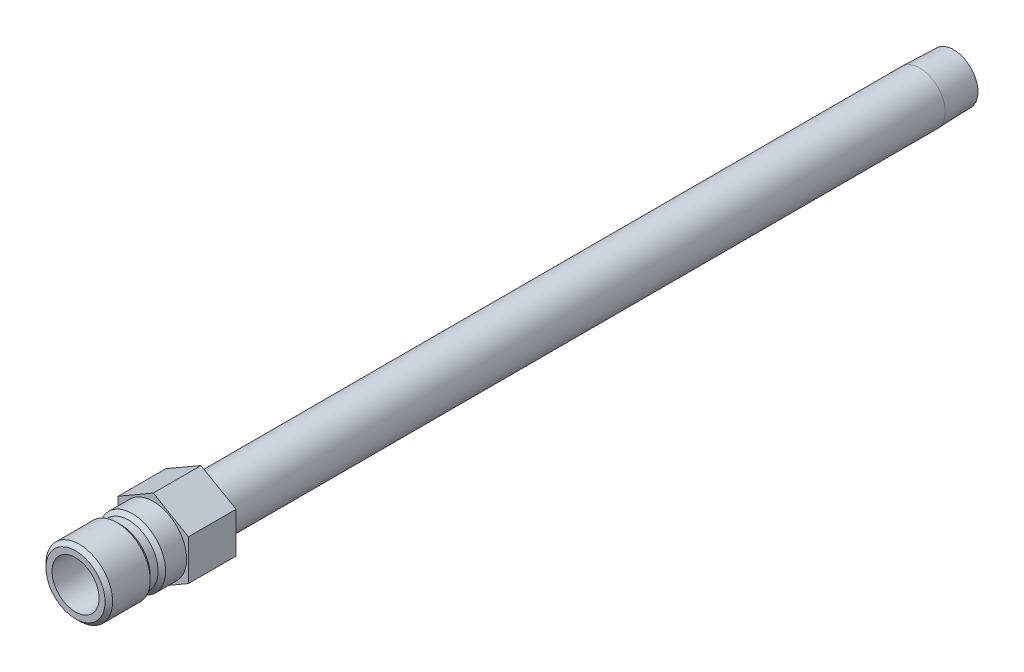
ISO-10303-21;
HEADER;
FILE_DESCRIPTION(('STEP AP214'),'2;1');
FILE_NAME('part.step','',(''),(''),'','','');
FILE_SCHEMA(('AUTOMOTIVE_DESIGN { 1 0 10303 214 1 1 1 1 }'));
ENDSEC;
DATA;
#1=APPLICATION_CONTEXT('core data for automotive mechanical design processes');
#2=APPLICATION_PROTOCOL_DEFINITION('international standard','automotive_design',2000,#1);
#3=PRODUCT_CONTEXT('',#1,'mechanical');
#4=PRODUCT('Part','Part','',(#3));
#5=PRODUCT_RELATED_PRODUCT_CATEGORY('part','',(#4));
#6=PRODUCT_DEFINITION_FORMATION('','',#4);
#7=PRODUCT_DEFINITION_CONTEXT('part definition',#1,'design');
#8=PRODUCT_DEFINITION('design','',#6,#7);
#9=PRODUCT_DEFINITION_SHAPE('','',#8);
#10=(LENGTH_UNIT() NAMED_UNIT(*) SI_UNIT(.MILLI.,.METRE.));
#11=(NAMED_UNIT(*) PLANE_ANGLE_UNIT() SI_UNIT($,.RADIAN.));
#12=(NAMED_UNIT(*) SI_UNIT($,.STERADIAN.) SOLID_ANGLE_UNIT());
#13=UNCERTAINTY_MEASURE_WITH_UNIT(LENGTH_MEASURE(1.E-05),#10,'distance_accuracy_value','');
#14=(GEOMETRIC_REPRESENTATION_CONTEXT(3) GLOBAL_UNCERTAINTY_ASSIGNED_CONTEXT((#13)) GLOBAL_UNIT_ASSIGNED_CONTEXT((#10,
#11,#12)) REPRESENTATION_CONTEXT('',''));
#15=CARTESIAN_POINT('',(0.,0.,0.));
#16=DIRECTION('',(0.,0.,1.));
#17=DIRECTION('',(1.,0.,0.));
#18=AXIS2_PLACEMENT_3D('',#15,#16,#17);
#19=CARTESIAN_POINT('',(0.,0.,-9.652));
#20=DIRECTION('',(0.,0.,-1.));
#21=DIRECTION('',(0.,1.,0.));
#22=AXIS2_PLACEMENT_3D('',#19,#20,#21);
#23=CYLINDRICAL_SURFACE('',#22,4.7625);
#24=CARTESIAN_POINT('',(0.,0.,3.556));
#25=DIRECTION('',(0.,0.,-1.));
#26=DIRECTION('',(0.,1.,0.));
#27=AXIS2_PLACEMENT_3D('',#24,#25,#26);
#28=CIRCLE('',#27,4.7625);
#29=CARTESIAN_POINT('',(0.,4.7625,3.556));
#30=VERTEX_POINT('',#29);
#31=EDGE_CURVE('E137',#30,#30,#28,.T.);
#32=ORIENTED_EDGE('',*,*,#31,.T.);
#33=EDGE_LOOP('',(#32));
#34=FACE_BOUND('',#33,.T.);
#35=CARTESIAN_POINT('',(0.,0.,15.748));
#36=DIRECTION('',(0.,0.,-1.));
#37=DIRECTION('',(0.,1.,0.));
#38=AXIS2_PLACEMENT_3D('',#35,#36,#37);
#39=CIRCLE('',#38,4.7625);
#40=CARTESIAN_POINT('',(0.,4.7625,15.748));
#41=VERTEX_POINT('',#40);
#42=EDGE_CURVE('E41',#41,#41,#39,.T.);
#43=ORIENTED_EDGE('',*,*,#42,.F.);
#44=EDGE_LOOP('',(#43));
#45=FACE_BOUND('',#44,.T.);
#46=ADVANCED_FACE('F33',(#34,#45),#23,.F.);
#47=CARTESIAN_POINT('',(0.,4.7625,15.748));
#48=DIRECTION('',(0.,0.,1.));
#49=DIRECTION('',(0.,-1.,0.));
#50=AXIS2_PLACEMENT_3D('',#47,#48,#49);
#51=PLANE('',#50);
#52=ORIENTED_EDGE('',*,*,#42,.T.);
#53=EDGE_LOOP('',(#52));
#54=FACE_BOUND('',#53,.T.);
#55=CARTESIAN_POINT('',(0.,0.,15.748));
#56=DIRECTION('',(0.,0.,-1.));
#57=DIRECTION('',(0.,1.,0.));
#58=AXIS2_PLACEMENT_3D('',#55,#56,#57);
#59=CIRCLE('',#58,5.9817);
#60=CARTESIAN_POINT('',(0.,5.9817,15.748));
#61=VERTEX_POINT('',#60);
#62=EDGE_CURVE('E175',#61,#61,#59,.T.);
#63=ORIENTED_EDGE('',*,*,#62,.F.);
#64=EDGE_LOOP('',(#63));
#65=FACE_BOUND('',#64,.T.);
#66=ADVANCED_FACE('F180',(#54,#65),#51,.T.);
#67=CARTESIAN_POINT('',(0.,0.,14.986));
#68=DIRECTION('',(0.,0.,-1.));
#69=DIRECTION('',(0.,1.,0.));
#70=AXIS2_PLACEMENT_3D('',#67,#68,#69);
#71=CONICAL_SURFACE('',#70,6.7437,0.785398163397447);
#72=ORIENTED_EDGE('',*,*,#62,.T.);
#73=EDGE_LOOP('',(#72));
#74=FACE_BOUND('',#73,.T.);
#75=CARTESIAN_POINT('',(0.,0.,14.986));
#76=DIRECTION('',(0.,0.,-1.));
#77=DIRECTION('',(0.,1.,0.));
#78=AXIS2_PLACEMENT_3D('',#75,#76,#77);
#79=CIRCLE('',#78,6.7437);
#80=CARTESIAN_POINT('',(0.,6.7437,14.986));
#81=VERTEX_POINT('',#80);
#82=EDGE_CURVE('E172',#81,#81,#79,.T.);
#83=ORIENTED_EDGE('',*,*,#82,.F.);
#84=EDGE_LOOP('',(#83));
#85=FACE_BOUND('',#84,.T.);
#86=ADVANCED_FACE('F188',(#74,#85),#71,.T.);
#87=CARTESIAN_POINT('',(0.,0.,-9.652));
#88=DIRECTION('',(0.,0.,-1.));
#89=DIRECTION('',(0.,1.,0.));
#90=AXIS2_PLACEMENT_3D('',#87,#88,#89);
#91=CYLINDRICAL_SURFACE('',#90,6.7437);
#92=ORIENTED_EDGE('',*,*,#82,.T.);
#93=EDGE_LOOP('',(#92));
#94=FACE_BOUND('',#93,.T.);
#95=CARTESIAN_POINT('',(0.,0.,7.366));
#96=DIRECTION('',(0.,0.,-1.));
#97=DIRECTION('',(0.,1.,0.));
#98=AXIS2_PLACEMENT_3D('',#95,#96,#97);
#99=CIRCLE('',#98,6.7437);
#100=CARTESIAN_POINT('',(0.,6.7437,7.366));
#101=VERTEX_POINT('',#100);
#102=EDGE_CURVE('E169',#101,#101,#99,.T.);
#103=ORIENTED_EDGE('',*,*,#102,.F.);
#104=EDGE_LOOP('',(#103));
#105=FACE_BOUND('',#104,.T.);
#106=ADVANCED_FACE('F237',(#94,#105),#91,.T.);
#107=CARTESIAN_POINT('',(0.,0.,6.604));
#108=DIRECTION('',(0.,0.,1.));
#109=DIRECTION('',(0.,-1.,0.));
#110=AXIS2_PLACEMENT_3D('',#107,#108,#109);
#111=CONICAL_SURFACE('',#110,5.9817,0.785398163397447);
#112=ORIENTED_EDGE('',*,*,#102,.T.);
#113=EDGE_LOOP('',(#112));
#114=FACE_BOUND('',#113,.T.);
#115=CARTESIAN_POINT('',(0.,0.,6.604));
#116=DIRECTION('',(0.,0.,-1.));
#117=DIRECTION('',(0.,1.,0.));
#118=AXIS2_PLACEMENT_3D('',#115,#116,#117);
#119=CIRCLE('',#118,5.9817);
#120=CARTESIAN_POINT('',(0.,5.9817,6.604));
#121=VERTEX_POINT('',#120);
#122=EDGE_CURVE('E166',#121,#121,#119,.T.);
#123=ORIENTED_EDGE('',*,*,#122,.F.);
#124=EDGE_LOOP('',(#123));
#125=FACE_BOUND('',#124,.T.);
#126=ADVANCED_FACE('F233',(#114,#125),#111,.T.);
#127=CARTESIAN_POINT('',(0.,0.,-9.652));
#128=DIRECTION('',(0.,0.,-1.));
#129=DIRECTION('',(0.,1.,0.));
#130=AXIS2_PLACEMENT_3D('',#127,#128,#129);
#131=CYLINDRICAL_SURFACE('',#130,5.9817);
#132=ORIENTED_EDGE('',*,*,#122,.T.);
#133=EDGE_LOOP('',(#132));
#134=FACE_BOUND('',#133,.T.);
#135=CARTESIAN_POINT('',(0.,0.,5.0165));
#136=DIRECTION('',(0.,0.,-1.));
#137=DIRECTION('',(0.,1.,0.));
#138=AXIS2_PLACEMENT_3D('',#135,#136,#137);
#139=CIRCLE('',#138,5.9817);
#140=CARTESIAN_POINT('',(0.,5.9817,5.0165));
#141=VERTEX_POINT('',#140);
#142=EDGE_CURVE('E163',#141,#141,#139,.T.);
#143=ORIENTED_EDGE('',*,*,#142,.F.);
#144=EDGE_LOOP('',(#143));
#145=FACE_BOUND('',#144,.T.);
#146=ADVANCED_FACE('F229',(#134,#145),#131,.T.);
#147=CARTESIAN_POINT('',(0.,0.,4.2545));
#148=DIRECTION('',(0.,0.,-1.));
#149=DIRECTION('',(0.,1.,0.));
#150=AXIS2_PLACEMENT_3D('',#147,#148,#149);
#151=CONICAL_SURFACE('',#150,6.7437,0.785398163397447);
#152=ORIENTED_EDGE('',*,*,#142,.T.);
#153=EDGE_LOOP('',(#152));
#154=FACE_BOUND('',#153,.T.);
#155=CARTESIAN_POINT('',(0.,0.,4.2545));
#156=DIRECTION('',(0.,0.,-1.));
#157=DIRECTION('',(0.,1.,0.));
#158=AXIS2_PLACEMENT_3D('',#155,#156,#157);
#159=CIRCLE('',#158,6.7437);
#160=CARTESIAN_POINT('',(0.,6.7437,4.2545));
#161=VERTEX_POINT('',#160);
#162=EDGE_CURVE('E160',#161,#161,#159,.T.);
#163=ORIENTED_EDGE('',*,*,#162,.F.);
#164=EDGE_LOOP('',(#163));
#165=FACE_BOUND('',#164,.T.);
#166=ADVANCED_FACE('F225',(#154,#165),#151,.T.);
#167=CARTESIAN_POINT('',(0.,0.,-9.652));
#168=DIRECTION('',(0.,0.,-1.));
#169=DIRECTION('',(0.,1.,0.));
#170=AXIS2_PLACEMENT_3D('',#167,#168,#169);
#171=CYLINDRICAL_SURFACE('',#170,6.7437);
#172=CARTESIAN_POINT('',(0.,0.,0.));
#173=DIRECTION('',(0.,0.,1.));
#174=DIRECTION('',(1.,0.,0.));
#175=AXIS2_PLACEMENT_3D('',#172,#173,#174);
#176=CIRCLE('',#175,6.7437);
#177=CARTESIAN_POINT('',(6.7437,0.,0.));
#178=VERTEX_POINT('',#177);
#179=EDGE_CURVE('E11',#178,#178,#176,.F.);
#180=ORIENTED_EDGE('',*,*,#179,.F.);
#181=EDGE_LOOP('',(#180));
#182=FACE_BOUND('',#181,.T.);
#183=ORIENTED_EDGE('',*,*,#162,.T.);
#184=EDGE_LOOP('',(#183));
#185=FACE_BOUND('',#184,.T.);
#186=ADVANCED_FACE('F221',(#182,#185),#171,.T.);
#187=CARTESIAN_POINT('',(0.,6.7437,-9.652));
#188=DIRECTION('',(0.,0.,-1.));
#189=DIRECTION('',(0.,1.,0.));
#190=AXIS2_PLACEMENT_3D('',#187,#188,#189);
#191=PLANE('',#190);
#192=CARTESIAN_POINT('',(0.,0.,-9.652));
#193=DIRECTION('',(0.,0.,-1.));
#194=DIRECTION('',(0.,1.,0.));
#195=AXIS2_PLACEMENT_3D('',#192,#193,#194);
#196=CIRCLE('',#195,5.1435);
#197=CARTESIAN_POINT('',(0.,5.1435,-9.652));
#198=VERTEX_POINT('',#197);
#199=EDGE_CURVE('E157',#198,#198,#196,.T.);
#200=ORIENTED_EDGE('',*,*,#199,.F.);
#201=EDGE_LOOP('',(#200));
#202=FACE_BOUND('',#201,.T.);
#203=DIRECTION('',(-0.866025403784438,-0.5,0.));
#204=VECTOR('',#203,1.);
#205=CARTESIAN_POINT('',(0.,8.21223022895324,-9.652));
#206=LINE('',#205,#204);
#207=CARTESIAN_POINT('',(0.,8.21223022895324,-9.652));
#208=VERTEX_POINT('',#207);
#209=CARTESIAN_POINT('',(-7.112,4.10611511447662,-9.652));
#210=VERTEX_POINT('',#209);
#211=EDGE_CURVE('E135',#208,#210,#206,.T.);
#212=ORIENTED_EDGE('',*,*,#211,.F.);
#213=DIRECTION('',(-0.866025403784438,0.5,0.));
#214=VECTOR('',#213,1.);
#215=CARTESIAN_POINT('',(7.112,4.10611511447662,-9.652));
#216=LINE('',#215,#214);
#217=CARTESIAN_POINT('',(7.112,4.10611511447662,-9.652));
#218=VERTEX_POINT('',#217);
#219=EDGE_CURVE('E110',#218,#208,#216,.T.);
#220=ORIENTED_EDGE('',*,*,#219,.F.);
#221=DIRECTION('',(0.,1.,0.));
#222=VECTOR('',#221,1.);
#223=CARTESIAN_POINT('',(7.112,-4.10611511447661,-9.652));
#224=LINE('',#223,#222);
#225=CARTESIAN_POINT('',(7.112,-4.10611511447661,-9.652));
#226=VERTEX_POINT('',#225);
#227=EDGE_CURVE('E95',#226,#218,#224,.T.);
#228=ORIENTED_EDGE('',*,*,#227,.F.);
#229=DIRECTION('',(0.866025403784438,0.5,0.));
#230=VECTOR('',#229,1.);
#231=CARTESIAN_POINT('',(0.,-8.21223022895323,-9.652));
#232=LINE('',#231,#230);
#233=CARTESIAN_POINT('',(0.,-8.21223022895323,-9.652));
#234=VERTEX_POINT('',#233);
#235=EDGE_CURVE('E108',#234,#226,#232,.T.);
#236=ORIENTED_EDGE('',*,*,#235,.F.);
#237=DIRECTION('',(0.866025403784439,-0.5,0.));
#238=VECTOR('',#237,1.);
#239=CARTESIAN_POINT('',(-7.112,-4.10611511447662,-9.652));
#240=LINE('',#239,#238);
#241=CARTESIAN_POINT('',(-7.112,-4.10611511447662,-9.652));
#242=VERTEX_POINT('',#241);
#243=EDGE_CURVE('E113',#242,#234,#240,.T.);
#244=ORIENTED_EDGE('',*,*,#243,.F.);
#245=DIRECTION('',(0.,-1.,0.));
#246=VECTOR('',#245,1.);
#247=CARTESIAN_POINT('',(-7.112,4.10611511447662,-9.652));
#248=LINE('',#247,#246);
#249=EDGE_CURVE('E115',#210,#242,#248,.T.);
#250=ORIENTED_EDGE('',*,*,#249,.F.);
#251=EDGE_LOOP('',(#212,#220,#228,#236,#244,#250));
#252=FACE_BOUND('',#251,.T.);
#253=ADVANCED_FACE('F106',(#202,#252),#191,.T.);
#254=CARTESIAN_POINT('',(0.,0.,-9.652));
#255=DIRECTION('',(0.,0.,-1.));
#256=DIRECTION('',(0.,1.,0.));
#257=AXIS2_PLACEMENT_3D('',#254,#255,#256);
#258=CYLINDRICAL_SURFACE('',#257,5.1435);
#259=ORIENTED_EDGE('',*,*,#199,.T.);
#260=EDGE_LOOP('',(#259));
#261=FACE_BOUND('',#260,.T.);
#262=CARTESIAN_POINT('',(0.,0.,-155.194));
#263=DIRECTION('',(0.,0.,-1.));
#264=DIRECTION('',(0.,1.,0.));
#265=AXIS2_PLACEMENT_3D('',#262,#263,#264);
#266=CIRCLE('',#265,5.14349999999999);
#267=CARTESIAN_POINT('',(0.,5.1435,-155.194));
#268=VERTEX_POINT('',#267);
#269=EDGE_CURVE('E154',#268,#268,#266,.T.);
#270=ORIENTED_EDGE('',*,*,#269,.F.);
#271=EDGE_LOOP('',(#270));
#272=FACE_BOUND('',#271,.T.);
#273=ADVANCED_FACE('F214',(#261,#272),#258,.T.);
#274=CARTESIAN_POINT('',(0.,0.,-162.052));
#275=DIRECTION('',(0.,0.,1.));
#276=DIRECTION('',(0.,-1.,0.));
#277=AXIS2_PLACEMENT_3D('',#274,#275,#276);
#278=CONICAL_SURFACE('',#277,4.92918877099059,0.0312396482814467);
#279=ORIENTED_EDGE('',*,*,#269,.T.);
#280=EDGE_LOOP('',(#279));
#281=FACE_BOUND('',#280,.T.);
#282=CARTESIAN_POINT('',(0.,0.,-162.052));
#283=DIRECTION('',(0.,0.,-1.));
#284=DIRECTION('',(0.,1.,0.));
#285=AXIS2_PLACEMENT_3D('',#282,#283,#284);
#286=CIRCLE('',#285,4.92918877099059);
#287=CARTESIAN_POINT('',(0.,4.9291887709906,-162.052));
#288=VERTEX_POINT('',#287);
#289=EDGE_CURVE('E151',#288,#288,#286,.T.);
#290=ORIENTED_EDGE('',*,*,#289,.F.);
#291=EDGE_LOOP('',(#290));
#292=FACE_BOUND('',#291,.T.);
#293=ADVANCED_FACE('F210',(#281,#292),#278,.T.);
#294=CARTESIAN_POINT('',(0.,4.9291887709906,-162.052));
#295=DIRECTION('',(0.,0.,-1.));
#296=DIRECTION('',(0.,1.,0.));
#297=AXIS2_PLACEMENT_3D('',#294,#295,#296);
#298=PLANE('',#297);
#299=ORIENTED_EDGE('',*,*,#289,.T.);
#300=EDGE_LOOP('',(#299));
#301=FACE_BOUND('',#300,.T.);
#302=CARTESIAN_POINT('',(0.,0.,-162.052));
#303=DIRECTION('',(0.,0.,-1.));
#304=DIRECTION('',(0.,1.,0.));
#305=AXIS2_PLACEMENT_3D('',#302,#303,#304);
#306=CIRCLE('',#305,3.41629999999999);
#307=CARTESIAN_POINT('',(0.,3.4163,-162.052));
#308=VERTEX_POINT('',#307);
#309=EDGE_CURVE('E148',#308,#308,#306,.T.);
#310=ORIENTED_EDGE('',*,*,#309,.F.);
#311=EDGE_LOOP('',(#310));
#312=FACE_BOUND('',#311,.T.);
#313=ADVANCED_FACE('F203',(#301,#312),#298,.T.);
#314=CARTESIAN_POINT('',(0.,0.,-9.652));
#315=DIRECTION('',(0.,0.,-1.));
#316=DIRECTION('',(0.,1.,0.));
#317=AXIS2_PLACEMENT_3D('',#314,#315,#316);
#318=CYLINDRICAL_SURFACE('',#317,3.41629999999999);
#319=ORIENTED_EDGE('',*,*,#309,.T.);
#320=EDGE_LOOP('',(#319));
#321=FACE_BOUND('',#320,.T.);
#322=CARTESIAN_POINT('',(0.,0.,2.84021276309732));
#323=DIRECTION('',(0.,0.,-1.));
#324=DIRECTION('',(0.,1.,0.));
#325=AXIS2_PLACEMENT_3D('',#322,#323,#324);
#326=CIRCLE('',#325,3.4163);
#327=CARTESIAN_POINT('',(0.,3.4163,2.84021276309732));
#328=VERTEX_POINT('',#327);
#329=EDGE_CURVE('E145',#328,#328,#326,.T.);
#330=ORIENTED_EDGE('',*,*,#329,.F.);
#331=EDGE_LOOP('',(#330));
#332=FACE_BOUND('',#331,.T.);
#333=ADVANCED_FACE('F194',(#321,#332),#318,.F.);
#334=CARTESIAN_POINT('',(0.,0.,3.556));
#335=DIRECTION('',(0.,0.,1.));
#336=DIRECTION('',(0.,-1.,0.));
#337=AXIS2_PLACEMENT_3D('',#334,#335,#336);
#338=CONICAL_SURFACE('',#337,4.7625,1.08210413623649);
#339=ORIENTED_EDGE('',*,*,#329,.T.);
#340=EDGE_LOOP('',(#339));
#341=FACE_BOUND('',#340,.T.);
#342=ORIENTED_EDGE('',*,*,#31,.F.);
#343=EDGE_LOOP('',(#342));
#344=FACE_BOUND('',#343,.T.);
#345=ADVANCED_FACE('F191',(#341,#344),#338,.F.);
#346=CARTESIAN_POINT('',(0.,8.21223022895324,-9.652));
#347=DIRECTION('',(-0.5,0.866025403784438,0.));
#348=DIRECTION('',(-0.866025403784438,-0.5,0.));
#349=AXIS2_PLACEMENT_3D('',#346,#347,#348);
#350=PLANE('',#349);
#351=DIRECTION('',(-0.866025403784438,-0.5,0.));
#352=VECTOR('',#351,1.);
#353=CARTESIAN_POINT('',(0.,8.21223022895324,0.));
#354=LINE('',#353,#352);
#355=CARTESIAN_POINT('',(0.,8.21223022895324,0.));
#356=VERTEX_POINT('',#355);
#357=CARTESIAN_POINT('',(-7.112,4.10611511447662,0.));
#358=VERTEX_POINT('',#357);
#359=EDGE_CURVE('E120',#356,#358,#354,.T.);
#360=ORIENTED_EDGE('',*,*,#359,.F.);
#361=DIRECTION('',(0.,0.,1.));
#362=VECTOR('',#361,1.);
#363=CARTESIAN_POINT('',(0.,8.21223022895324,-9.652));
#364=LINE('',#363,#362);
#365=EDGE_CURVE('E49',#208,#356,#364,.T.);
#366=ORIENTED_EDGE('',*,*,#365,.F.);
#367=ORIENTED_EDGE('',*,*,#211,.T.);
#368=DIRECTION('',(0.,0.,1.));
#369=VECTOR('',#368,1.);
#370=CARTESIAN_POINT('',(-7.112,4.10611511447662,-9.652));
#371=LINE('',#370,#369);
#372=EDGE_CURVE('E84',#210,#358,#371,.T.);
#373=ORIENTED_EDGE('',*,*,#372,.T.);
#374=EDGE_LOOP('',(#360,#366,#367,#373));
#375=FACE_BOUND('',#374,.T.);
#376=ADVANCED_FACE('F193',(#375),#350,.T.);
#377=CARTESIAN_POINT('',(7.112,4.10611511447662,-9.652));
#378=DIRECTION('',(0.5,0.866025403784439,0.));
#379=DIRECTION('',(-0.866025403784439,0.5,0.));
#380=AXIS2_PLACEMENT_3D('',#377,#378,#379);
#381=PLANE('',#380);
#382=DIRECTION('',(-0.866025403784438,0.5,0.));
#383=VECTOR('',#382,1.);
#384=CARTESIAN_POINT('',(7.112,4.10611511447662,0.));
#385=LINE('',#384,#383);
#386=CARTESIAN_POINT('',(7.112,4.10611511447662,0.));
#387=VERTEX_POINT('',#386);
#388=EDGE_CURVE('E132',#387,#356,#385,.T.);
#389=ORIENTED_EDGE('',*,*,#388,.F.);
#390=DIRECTION('',(0.,0.,1.));
#391=VECTOR('',#390,1.);
#392=CARTESIAN_POINT('',(7.112,4.10611511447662,-9.652));
#393=LINE('',#392,#391);
#394=EDGE_CURVE('E72',#218,#387,#393,.T.);
#395=ORIENTED_EDGE('',*,*,#394,.F.);
#396=ORIENTED_EDGE('',*,*,#219,.T.);
#397=ORIENTED_EDGE('',*,*,#365,.T.);
#398=EDGE_LOOP('',(#389,#395,#396,#397));
#399=FACE_BOUND('',#398,.T.);
#400=ADVANCED_FACE('F201',(#399),#381,.T.);
#401=CARTESIAN_POINT('',(7.112,-4.10611511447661,-9.652));
#402=DIRECTION('',(1.,0.,0.));
#403=DIRECTION('',(0.,1.,0.));
#404=AXIS2_PLACEMENT_3D('',#401,#402,#403);
#405=PLANE('',#404);
#406=DIRECTION('',(0.,1.,0.));
#407=VECTOR('',#406,1.);
#408=CARTESIAN_POINT('',(7.112,-4.10611511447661,0.));
#409=LINE('',#408,#407);
#410=CARTESIAN_POINT('',(7.112,-4.10611511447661,0.));
#411=VERTEX_POINT('',#410);
#412=EDGE_CURVE('E97',#411,#387,#409,.T.);
#413=ORIENTED_EDGE('',*,*,#412,.F.);
#414=DIRECTION('',(0.,0.,1.));
#415=VECTOR('',#414,1.);
#416=CARTESIAN_POINT('',(7.112,-4.10611511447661,-9.652));
#417=LINE('',#416,#415);
#418=EDGE_CURVE('E92',#226,#411,#417,.T.);
#419=ORIENTED_EDGE('',*,*,#418,.F.);
#420=ORIENTED_EDGE('',*,*,#227,.T.);
#421=ORIENTED_EDGE('',*,*,#394,.T.);
#422=EDGE_LOOP('',(#413,#419,#420,#421));
#423=FACE_BOUND('',#422,.T.);
#424=ADVANCED_FACE('F94',(#423),#405,.T.);
#425=CARTESIAN_POINT('',(0.,-8.21223022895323,-9.652));
#426=DIRECTION('',(0.5,-0.866025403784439,0.));
#427=DIRECTION('',(0.866025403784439,0.5,0.));
#428=AXIS2_PLACEMENT_3D('',#425,#426,#427);
#429=PLANE('',#428);
#430=DIRECTION('',(0.866025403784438,0.5,0.));
#431=VECTOR('',#430,1.);
#432=CARTESIAN_POINT('',(0.,-8.21223022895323,0.));
#433=LINE('',#432,#431);
#434=CARTESIAN_POINT('',(0.,-8.21223022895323,0.));
#435=VERTEX_POINT('',#434);
#436=EDGE_CURVE('E129',#435,#411,#433,.T.);
#437=ORIENTED_EDGE('',*,*,#436,.F.);
#438=DIRECTION('',(0.,0.,1.));
#439=VECTOR('',#438,1.);
#440=CARTESIAN_POINT('',(0.,-8.21223022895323,-9.652));
#441=LINE('',#440,#439);
#442=EDGE_CURVE('E102',#234,#435,#441,.T.);
#443=ORIENTED_EDGE('',*,*,#442,.F.);
#444=ORIENTED_EDGE('',*,*,#235,.T.);
#445=ORIENTED_EDGE('',*,*,#418,.T.);
#446=EDGE_LOOP('',(#437,#443,#444,#445));
#447=FACE_BOUND('',#446,.T.);
#448=ADVANCED_FACE('F112',(#447),#429,.T.);
#449=CARTESIAN_POINT('',(-7.112,-4.10611511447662,-9.652));
#450=DIRECTION('',(-0.5,-0.866025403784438,0.));
#451=DIRECTION('',(0.866025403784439,-0.5,0.));
#452=AXIS2_PLACEMENT_3D('',#449,#450,#451);
#453=PLANE('',#452);
#454=DIRECTION('',(0.866025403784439,-0.5,0.));
#455=VECTOR('',#454,1.);
#456=CARTESIAN_POINT('',(-7.112,-4.10611511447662,0.));
#457=LINE('',#456,#455);
#458=CARTESIAN_POINT('',(-7.112,-4.10611511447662,0.));
#459=VERTEX_POINT('',#458);
#460=EDGE_CURVE('E126',#459,#435,#457,.T.);
#461=ORIENTED_EDGE('',*,*,#460,.F.);
#462=DIRECTION('',(0.,0.,1.));
#463=VECTOR('',#462,1.);
#464=CARTESIAN_POINT('',(-7.112,-4.10611511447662,-9.652));
#465=LINE('',#464,#463);
#466=EDGE_CURVE('E140',#242,#459,#465,.T.);
#467=ORIENTED_EDGE('',*,*,#466,.F.);
#468=ORIENTED_EDGE('',*,*,#243,.T.);
#469=ORIENTED_EDGE('',*,*,#442,.T.);
#470=EDGE_LOOP('',(#461,#467,#468,#469));
#471=FACE_BOUND('',#470,.T.);
#472=ADVANCED_FACE('F338',(#471),#453,.T.);
#473=CARTESIAN_POINT('',(-7.112,4.10611511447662,-9.652));
#474=DIRECTION('',(-1.,0.,0.));
#475=DIRECTION('',(0.,-1.,0.));
#476=AXIS2_PLACEMENT_3D('',#473,#474,#475);
#477=PLANE('',#476);
#478=DIRECTION('',(0.,-1.,0.));
#479=VECTOR('',#478,1.);
#480=CARTESIAN_POINT('',(-7.112,4.10611511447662,0.));
#481=LINE('',#480,#479);
#482=EDGE_CURVE('E123',#358,#459,#481,.T.);
#483=ORIENTED_EDGE('',*,*,#482,.F.);
#484=ORIENTED_EDGE('',*,*,#372,.F.);
#485=ORIENTED_EDGE('',*,*,#249,.T.);
#486=ORIENTED_EDGE('',*,*,#466,.T.);
#487=EDGE_LOOP('',(#483,#484,#485,#486));
#488=FACE_BOUND('',#487,.T.);
#489=ADVANCED_FACE('F346',(#488),#477,.T.);
#490=CARTESIAN_POINT('',(-7.112,4.10611511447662,0.));
#491=DIRECTION('',(0.,0.,1.));
#492=DIRECTION('',(1.,0.,0.));
#493=AXIS2_PLACEMENT_3D('',#490,#491,#492);
#494=PLANE('',#493);
#495=ORIENTED_EDGE('',*,*,#179,.T.);
#496=EDGE_LOOP('',(#495));
#497=FACE_BOUND('',#496,.T.);
#498=ORIENTED_EDGE('',*,*,#359,.T.);
#499=ORIENTED_EDGE('',*,*,#482,.T.);
#500=ORIENTED_EDGE('',*,*,#460,.T.);
#501=ORIENTED_EDGE('',*,*,#436,.T.);
#502=ORIENTED_EDGE('',*,*,#412,.T.);
#503=ORIENTED_EDGE('',*,*,#388,.T.);
#504=EDGE_LOOP('',(#498,#499,#500,#501,#502,#503));
#505=FACE_BOUND('',#504,.T.);
#506=ADVANCED_FACE('F355',(#497,#505),#494,.T.);
#507=CLOSED_SHELL('',(#46,#66,#86,#106,#126,#146,#166,#186,#253,#273,#293,#313,#333,#345,#376,
#400,#424,#448,#472,#489,#506));
#508=MANIFOLD_SOLID_BREP('B2',#507);
#509=ADVANCED_BREP_SHAPE_REPRESENTATION('',(#18,#508),#14);
#510=SHAPE_DEFINITION_REPRESENTATION(#9,#509);
ENDSEC;
END-ISO-10303-21;
